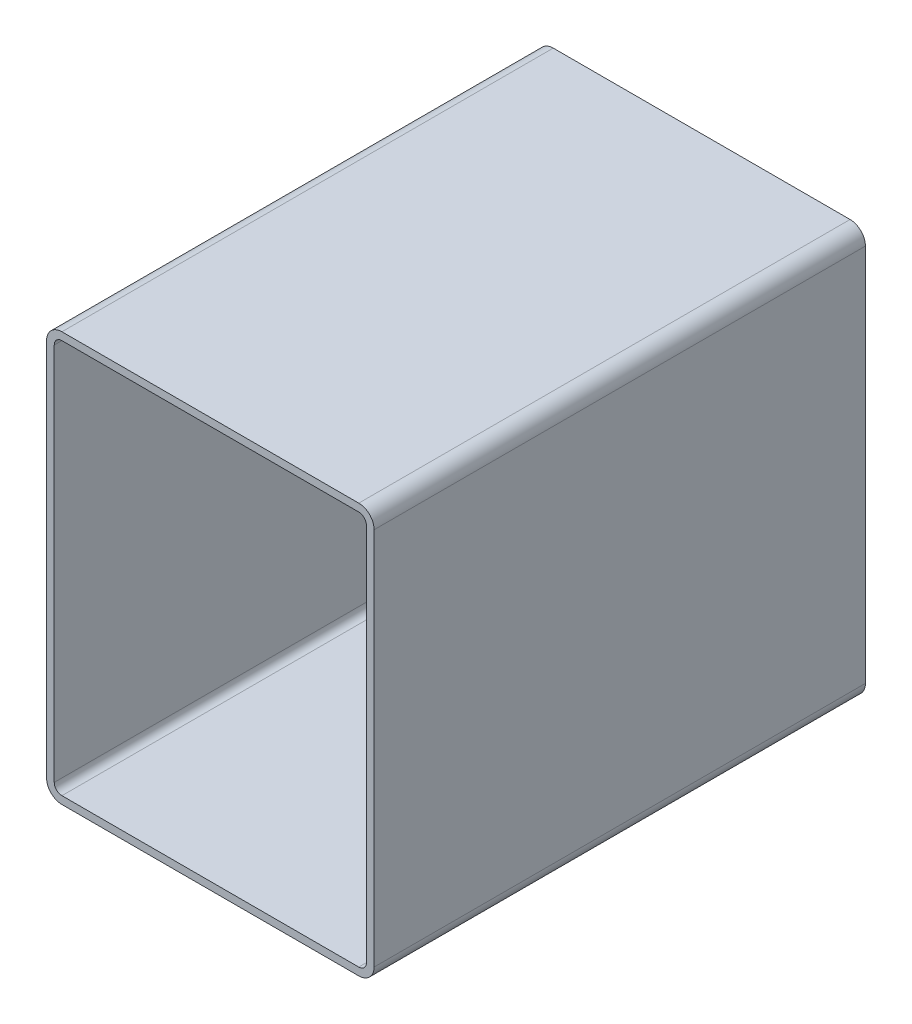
ISO-10303-21;
HEADER;
FILE_DESCRIPTION(('STEP AP214'),'2;1');
FILE_NAME('part.step','',(''),(''),'','','');
FILE_SCHEMA(('AUTOMOTIVE_DESIGN { 1 0 10303 214 1 1 1 1 }'));
ENDSEC;
DATA;
#1=APPLICATION_CONTEXT('core data for automotive mechanical design processes');
#2=APPLICATION_PROTOCOL_DEFINITION('international standard','automotive_design',2000,#1);
#3=PRODUCT_CONTEXT('',#1,'mechanical');
#4=PRODUCT('Part','Part','',(#3));
#5=PRODUCT_RELATED_PRODUCT_CATEGORY('part','',(#4));
#6=PRODUCT_DEFINITION_FORMATION('','',#4);
#7=PRODUCT_DEFINITION_CONTEXT('part definition',#1,'design');
#8=PRODUCT_DEFINITION('design','',#6,#7);
#9=PRODUCT_DEFINITION_SHAPE('','',#8);
#10=(LENGTH_UNIT() NAMED_UNIT(*) SI_UNIT(.MILLI.,.METRE.));
#11=(NAMED_UNIT(*) PLANE_ANGLE_UNIT() SI_UNIT($,.RADIAN.));
#12=(NAMED_UNIT(*) SI_UNIT($,.STERADIAN.) SOLID_ANGLE_UNIT());
#13=UNCERTAINTY_MEASURE_WITH_UNIT(LENGTH_MEASURE(1.E-05),#10,'distance_accuracy_value','');
#14=(GEOMETRIC_REPRESENTATION_CONTEXT(3) GLOBAL_UNCERTAINTY_ASSIGNED_CONTEXT((#13)) GLOBAL_UNIT_ASSIGNED_CONTEXT((#10,
#11,#12)) REPRESENTATION_CONTEXT('',''));
#15=CARTESIAN_POINT('',(0.,0.,0.));
#16=DIRECTION('',(0.,0.,1.));
#17=DIRECTION('',(1.,0.,0.));
#18=AXIS2_PLACEMENT_3D('',#15,#16,#17);
#19=CARTESIAN_POINT('',(10.9159404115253,246.395313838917,304.8));
#20=DIRECTION('',(0.,0.,1.));
#21=DIRECTION('',(1.,0.,0.));
#22=AXIS2_PLACEMENT_3D('',#19,#20,#21);
#23=PLANE('',#22);
#24=CARTESIAN_POINT('',(10.9159404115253,246.395313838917,304.8));
#25=DIRECTION('',(0.,0.,1.));
#26=DIRECTION('',(1.,0.,0.));
#27=AXIS2_PLACEMENT_3D('',#24,#25,#26);
#28=CIRCLE('',#27,9.52500000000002);
#29=CARTESIAN_POINT('',(10.9159404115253,255.920313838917,304.8));
#30=VERTEX_POINT('',#29);
#31=CARTESIAN_POINT('',(1.3909404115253,246.395313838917,304.8));
#32=VERTEX_POINT('',#31);
#33=EDGE_CURVE('E211',#30,#32,#28,.T.);
#34=ORIENTED_EDGE('',*,*,#33,.T.);
#35=DIRECTION('',(0.,-1.,0.));
#36=VECTOR('',#35,1.);
#37=CARTESIAN_POINT('',(1.3909404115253,11.4453138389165,304.8));
#38=LINE('',#37,#36);
#39=CARTESIAN_POINT('',(1.3909404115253,11.4453138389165,304.8));
#40=VERTEX_POINT('',#39);
#41=EDGE_CURVE('E214',#32,#40,#38,.T.);
#42=ORIENTED_EDGE('',*,*,#41,.T.);
#43=CARTESIAN_POINT('',(10.9159404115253,11.4453138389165,304.8));
#44=DIRECTION('',(0.,0.,1.));
#45=DIRECTION('',(1.,0.,0.));
#46=AXIS2_PLACEMENT_3D('',#43,#44,#45);
#47=CIRCLE('',#46,9.525);
#48=CARTESIAN_POINT('',(10.9159404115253,1.92031383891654,304.8));
#49=VERTEX_POINT('',#48);
#50=EDGE_CURVE('E217',#40,#49,#47,.T.);
#51=ORIENTED_EDGE('',*,*,#50,.T.);
#52=DIRECTION('',(1.,0.,0.));
#53=VECTOR('',#52,1.);
#54=CARTESIAN_POINT('',(195.065940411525,1.92031383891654,304.8));
#55=LINE('',#54,#53);
#56=CARTESIAN_POINT('',(195.065940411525,1.92031383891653,304.8));
#57=VERTEX_POINT('',#56);
#58=EDGE_CURVE('E219',#49,#57,#55,.T.);
#59=ORIENTED_EDGE('',*,*,#58,.T.);
#60=CARTESIAN_POINT('',(195.065940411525,11.4453138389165,304.8));
#61=DIRECTION('',(0.,0.,1.));
#62=DIRECTION('',(1.,0.,0.));
#63=AXIS2_PLACEMENT_3D('',#60,#61,#62);
#64=CIRCLE('',#63,9.525);
#65=CARTESIAN_POINT('',(204.590940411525,11.4453138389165,304.8));
#66=VERTEX_POINT('',#65);
#67=EDGE_CURVE('E221',#57,#66,#64,.T.);
#68=ORIENTED_EDGE('',*,*,#67,.T.);
#69=DIRECTION('',(0.,1.,0.));
#70=VECTOR('',#69,1.);
#71=CARTESIAN_POINT('',(204.590940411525,246.395313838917,304.8));
#72=LINE('',#71,#70);
#73=CARTESIAN_POINT('',(204.590940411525,246.395313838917,304.8));
#74=VERTEX_POINT('',#73);
#75=EDGE_CURVE('E223',#66,#74,#72,.T.);
#76=ORIENTED_EDGE('',*,*,#75,.T.);
#77=CARTESIAN_POINT('',(195.065940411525,246.395313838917,304.8));
#78=DIRECTION('',(0.,0.,1.));
#79=DIRECTION('',(1.,0.,0.));
#80=AXIS2_PLACEMENT_3D('',#77,#78,#79);
#81=CIRCLE('',#80,9.52500000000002);
#82=CARTESIAN_POINT('',(195.065940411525,255.920313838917,304.8));
#83=VERTEX_POINT('',#82);
#84=EDGE_CURVE('E225',#74,#83,#81,.T.);
#85=ORIENTED_EDGE('',*,*,#84,.T.);
#86=DIRECTION('',(-1.,0.,0.));
#87=VECTOR('',#86,1.);
#88=CARTESIAN_POINT('',(10.9159404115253,255.920313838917,304.8));
#89=LINE('',#88,#87);
#90=EDGE_CURVE('E227',#83,#30,#89,.T.);
#91=ORIENTED_EDGE('',*,*,#90,.T.);
#92=EDGE_LOOP('',(#34,#42,#51,#59,#68,#76,#85,#91));
#93=FACE_BOUND('',#92,.T.);
#94=DIRECTION('',(0.,-1.,0.));
#95=VECTOR('',#94,1.);
#96=CARTESIAN_POINT('',(6.1534404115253,11.4453138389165,304.8));
#97=LINE('',#96,#95);
#98=CARTESIAN_POINT('',(6.1534404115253,246.395313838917,304.8));
#99=VERTEX_POINT('',#98);
#100=CARTESIAN_POINT('',(6.1534404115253,11.4453138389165,304.8));
#101=VERTEX_POINT('',#100);
#102=EDGE_CURVE('E154',#99,#101,#97,.T.);
#103=ORIENTED_EDGE('',*,*,#102,.F.);
#104=CARTESIAN_POINT('',(10.9159404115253,246.395313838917,304.8));
#105=DIRECTION('',(0.,0.,1.));
#106=DIRECTION('',(1.,0.,0.));
#107=AXIS2_PLACEMENT_3D('',#104,#105,#106);
#108=CIRCLE('',#107,4.76250000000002);
#109=CARTESIAN_POINT('',(10.9159404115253,251.157813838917,304.8));
#110=VERTEX_POINT('',#109);
#111=EDGE_CURVE('E146',#110,#99,#108,.T.);
#112=ORIENTED_EDGE('',*,*,#111,.F.);
#113=DIRECTION('',(-1.,0.,0.));
#114=VECTOR('',#113,1.);
#115=CARTESIAN_POINT('',(10.9159404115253,251.157813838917,304.8));
#116=LINE('',#115,#114);
#117=CARTESIAN_POINT('',(195.065940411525,251.157813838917,304.8));
#118=VERTEX_POINT('',#117);
#119=EDGE_CURVE('E179',#118,#110,#116,.T.);
#120=ORIENTED_EDGE('',*,*,#119,.F.);
#121=CARTESIAN_POINT('',(195.065940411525,246.395313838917,304.8));
#122=DIRECTION('',(0.,0.,1.));
#123=DIRECTION('',(1.,0.,0.));
#124=AXIS2_PLACEMENT_3D('',#121,#122,#123);
#125=CIRCLE('',#124,4.76250000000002);
#126=CARTESIAN_POINT('',(199.828440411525,246.395313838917,304.8));
#127=VERTEX_POINT('',#126);
#128=EDGE_CURVE('E177',#127,#118,#125,.T.);
#129=ORIENTED_EDGE('',*,*,#128,.F.);
#130=DIRECTION('',(0.,1.,0.));
#131=VECTOR('',#130,1.);
#132=CARTESIAN_POINT('',(199.828440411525,246.395313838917,304.8));
#133=LINE('',#132,#131);
#134=CARTESIAN_POINT('',(199.828440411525,11.4453138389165,304.8));
#135=VERTEX_POINT('',#134);
#136=EDGE_CURVE('E175',#135,#127,#133,.T.);
#137=ORIENTED_EDGE('',*,*,#136,.F.);
#138=CARTESIAN_POINT('',(195.065940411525,11.4453138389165,304.8));
#139=DIRECTION('',(0.,0.,1.));
#140=DIRECTION('',(1.,0.,0.));
#141=AXIS2_PLACEMENT_3D('',#138,#139,#140);
#142=CIRCLE('',#141,4.7625);
#143=CARTESIAN_POINT('',(195.065940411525,6.68281383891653,304.8));
#144=VERTEX_POINT('',#143);
#145=EDGE_CURVE('E173',#144,#135,#142,.T.);
#146=ORIENTED_EDGE('',*,*,#145,.F.);
#147=DIRECTION('',(1.,0.,0.));
#148=VECTOR('',#147,1.);
#149=CARTESIAN_POINT('',(195.065940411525,6.68281383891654,304.8));
#150=LINE('',#149,#148);
#151=CARTESIAN_POINT('',(10.9159404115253,6.68281383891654,304.8));
#152=VERTEX_POINT('',#151);
#153=EDGE_CURVE('E169',#152,#144,#150,.T.);
#154=ORIENTED_EDGE('',*,*,#153,.F.);
#155=CARTESIAN_POINT('',(10.9159404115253,11.4453138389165,304.8));
#156=DIRECTION('',(0.,0.,1.));
#157=DIRECTION('',(1.,0.,0.));
#158=AXIS2_PLACEMENT_3D('',#155,#156,#157);
#159=CIRCLE('',#158,4.7625);
#160=EDGE_CURVE('E167',#101,#152,#159,.T.);
#161=ORIENTED_EDGE('',*,*,#160,.F.);
#162=EDGE_LOOP('',(#103,#112,#120,#129,#137,#146,#154,#161));
#163=FACE_BOUND('',#162,.T.);
#164=ADVANCED_FACE('F33',(#93,#163),#23,.T.);
#165=CARTESIAN_POINT('',(10.9159404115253,246.395313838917,0.));
#166=DIRECTION('',(0.,0.,1.));
#167=DIRECTION('',(1.,0.,0.));
#168=AXIS2_PLACEMENT_3D('',#165,#166,#167);
#169=PLANE('',#168);
#170=CARTESIAN_POINT('',(10.9159404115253,246.395313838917,0.));
#171=DIRECTION('',(0.,0.,1.));
#172=DIRECTION('',(1.,0.,0.));
#173=AXIS2_PLACEMENT_3D('',#170,#171,#172);
#174=CIRCLE('',#173,9.52500000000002);
#175=CARTESIAN_POINT('',(10.9159404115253,255.920313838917,0.));
#176=VERTEX_POINT('',#175);
#177=CARTESIAN_POINT('',(1.3909404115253,246.395313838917,0.));
#178=VERTEX_POINT('',#177);
#179=EDGE_CURVE('E162',#176,#178,#174,.T.);
#180=ORIENTED_EDGE('',*,*,#179,.F.);
#181=DIRECTION('',(-1.,0.,0.));
#182=VECTOR('',#181,1.);
#183=CARTESIAN_POINT('',(10.9159404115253,255.920313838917,0.));
#184=LINE('',#183,#182);
#185=CARTESIAN_POINT('',(195.065940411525,255.920313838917,0.));
#186=VERTEX_POINT('',#185);
#187=EDGE_CURVE('E215',#186,#176,#184,.T.);
#188=ORIENTED_EDGE('',*,*,#187,.F.);
#189=CARTESIAN_POINT('',(195.065940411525,246.395313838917,0.));
#190=DIRECTION('',(0.,0.,1.));
#191=DIRECTION('',(1.,0.,0.));
#192=AXIS2_PLACEMENT_3D('',#189,#190,#191);
#193=CIRCLE('',#192,9.52500000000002);
#194=CARTESIAN_POINT('',(204.590940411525,246.395313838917,0.));
#195=VERTEX_POINT('',#194);
#196=EDGE_CURVE('E242',#195,#186,#193,.T.);
#197=ORIENTED_EDGE('',*,*,#196,.F.);
#198=DIRECTION('',(0.,1.,0.));
#199=VECTOR('',#198,1.);
#200=CARTESIAN_POINT('',(204.590940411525,246.395313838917,0.));
#201=LINE('',#200,#199);
#202=CARTESIAN_POINT('',(204.590940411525,11.4453138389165,0.));
#203=VERTEX_POINT('',#202);
#204=EDGE_CURVE('E240',#203,#195,#201,.T.);
#205=ORIENTED_EDGE('',*,*,#204,.F.);
#206=CARTESIAN_POINT('',(195.065940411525,11.4453138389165,0.));
#207=DIRECTION('',(0.,0.,1.));
#208=DIRECTION('',(1.,0.,0.));
#209=AXIS2_PLACEMENT_3D('',#206,#207,#208);
#210=CIRCLE('',#209,9.525);
#211=CARTESIAN_POINT('',(195.065940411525,1.92031383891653,0.));
#212=VERTEX_POINT('',#211);
#213=EDGE_CURVE('E238',#212,#203,#210,.T.);
#214=ORIENTED_EDGE('',*,*,#213,.F.);
#215=DIRECTION('',(1.,0.,0.));
#216=VECTOR('',#215,1.);
#217=CARTESIAN_POINT('',(195.065940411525,1.92031383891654,0.));
#218=LINE('',#217,#216);
#219=CARTESIAN_POINT('',(10.9159404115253,1.92031383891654,0.));
#220=VERTEX_POINT('',#219);
#221=EDGE_CURVE('E236',#220,#212,#218,.T.);
#222=ORIENTED_EDGE('',*,*,#221,.F.);
#223=CARTESIAN_POINT('',(10.9159404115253,11.4453138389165,0.));
#224=DIRECTION('',(0.,0.,1.));
#225=DIRECTION('',(1.,0.,0.));
#226=AXIS2_PLACEMENT_3D('',#223,#224,#225);
#227=CIRCLE('',#226,9.525);
#228=CARTESIAN_POINT('',(1.3909404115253,11.4453138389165,0.));
#229=VERTEX_POINT('',#228);
#230=EDGE_CURVE('E234',#229,#220,#227,.T.);
#231=ORIENTED_EDGE('',*,*,#230,.F.);
#232=DIRECTION('',(0.,-1.,0.));
#233=VECTOR('',#232,1.);
#234=CARTESIAN_POINT('',(1.3909404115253,11.4453138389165,0.));
#235=LINE('',#234,#233);
#236=EDGE_CURVE('E232',#178,#229,#235,.T.);
#237=ORIENTED_EDGE('',*,*,#236,.F.);
#238=EDGE_LOOP('',(#180,#188,#197,#205,#214,#222,#231,#237));
#239=FACE_BOUND('',#238,.T.);
#240=CARTESIAN_POINT('',(10.9159404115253,246.395313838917,0.));
#241=DIRECTION('',(0.,0.,1.));
#242=DIRECTION('',(1.,0.,0.));
#243=AXIS2_PLACEMENT_3D('',#240,#241,#242);
#244=CIRCLE('',#243,4.76250000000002);
#245=CARTESIAN_POINT('',(10.9159404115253,251.157813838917,0.));
#246=VERTEX_POINT('',#245);
#247=CARTESIAN_POINT('',(6.1534404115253,246.395313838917,0.));
#248=VERTEX_POINT('',#247);
#249=EDGE_CURVE('E56',#246,#248,#244,.T.);
#250=ORIENTED_EDGE('',*,*,#249,.T.);
#251=DIRECTION('',(0.,-1.,0.));
#252=VECTOR('',#251,1.);
#253=CARTESIAN_POINT('',(6.1534404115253,11.4453138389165,0.));
#254=LINE('',#253,#252);
#255=CARTESIAN_POINT('',(6.1534404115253,11.4453138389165,0.));
#256=VERTEX_POINT('',#255);
#257=EDGE_CURVE('E161',#248,#256,#254,.T.);
#258=ORIENTED_EDGE('',*,*,#257,.T.);
#259=CARTESIAN_POINT('',(10.9159404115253,11.4453138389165,0.));
#260=DIRECTION('',(0.,0.,1.));
#261=DIRECTION('',(1.,0.,0.));
#262=AXIS2_PLACEMENT_3D('',#259,#260,#261);
#263=CIRCLE('',#262,4.7625);
#264=CARTESIAN_POINT('',(10.9159404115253,6.68281383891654,0.));
#265=VERTEX_POINT('',#264);
#266=EDGE_CURVE('E183',#256,#265,#263,.T.);
#267=ORIENTED_EDGE('',*,*,#266,.T.);
#268=DIRECTION('',(1.,0.,0.));
#269=VECTOR('',#268,1.);
#270=CARTESIAN_POINT('',(195.065940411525,6.68281383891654,0.));
#271=LINE('',#270,#269);
#272=CARTESIAN_POINT('',(195.065940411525,6.68281383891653,0.));
#273=VERTEX_POINT('',#272);
#274=EDGE_CURVE('E186',#265,#273,#271,.T.);
#275=ORIENTED_EDGE('',*,*,#274,.T.);
#276=CARTESIAN_POINT('',(195.065940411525,11.4453138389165,0.));
#277=DIRECTION('',(0.,0.,1.));
#278=DIRECTION('',(1.,0.,0.));
#279=AXIS2_PLACEMENT_3D('',#276,#277,#278);
#280=CIRCLE('',#279,4.7625);
#281=CARTESIAN_POINT('',(199.828440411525,11.4453138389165,0.));
#282=VERTEX_POINT('',#281);
#283=EDGE_CURVE('E189',#273,#282,#280,.T.);
#284=ORIENTED_EDGE('',*,*,#283,.T.);
#285=DIRECTION('',(0.,1.,0.));
#286=VECTOR('',#285,1.);
#287=CARTESIAN_POINT('',(199.828440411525,246.395313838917,0.));
#288=LINE('',#287,#286);
#289=CARTESIAN_POINT('',(199.828440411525,246.395313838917,0.));
#290=VERTEX_POINT('',#289);
#291=EDGE_CURVE('E192',#282,#290,#288,.T.);
#292=ORIENTED_EDGE('',*,*,#291,.T.);
#293=CARTESIAN_POINT('',(195.065940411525,246.395313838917,0.));
#294=DIRECTION('',(0.,0.,1.));
#295=DIRECTION('',(1.,0.,0.));
#296=AXIS2_PLACEMENT_3D('',#293,#294,#295);
#297=CIRCLE('',#296,4.76250000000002);
#298=CARTESIAN_POINT('',(195.065940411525,251.157813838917,0.));
#299=VERTEX_POINT('',#298);
#300=EDGE_CURVE('E195',#290,#299,#297,.T.);
#301=ORIENTED_EDGE('',*,*,#300,.T.);
#302=DIRECTION('',(-1.,0.,0.));
#303=VECTOR('',#302,1.);
#304=CARTESIAN_POINT('',(10.9159404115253,251.157813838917,0.));
#305=LINE('',#304,#303);
#306=EDGE_CURVE('E155',#299,#246,#305,.T.);
#307=ORIENTED_EDGE('',*,*,#306,.T.);
#308=EDGE_LOOP('',(#250,#258,#267,#275,#284,#292,#301,#307));
#309=FACE_BOUND('',#308,.T.);
#310=ADVANCED_FACE('F272',(#239,#309),#169,.F.);
#311=CARTESIAN_POINT('',(10.9159404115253,246.395313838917,304.8));
#312=DIRECTION('',(0.,0.,-1.));
#313=DIRECTION('',(-1.,0.,0.));
#314=AXIS2_PLACEMENT_3D('',#311,#312,#313);
#315=CYLINDRICAL_SURFACE('',#314,9.52500000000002);
#316=ORIENTED_EDGE('',*,*,#179,.T.);
#317=DIRECTION('',(0.,0.,-1.));
#318=VECTOR('',#317,1.);
#319=CARTESIAN_POINT('',(1.3909404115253,246.395313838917,304.8));
#320=LINE('',#319,#318);
#321=EDGE_CURVE('E11',#32,#178,#320,.T.);
#322=ORIENTED_EDGE('',*,*,#321,.F.);
#323=ORIENTED_EDGE('',*,*,#33,.F.);
#324=DIRECTION('',(0.,0.,-1.));
#325=VECTOR('',#324,1.);
#326=CARTESIAN_POINT('',(10.9159404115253,255.920313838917,304.8));
#327=LINE('',#326,#325);
#328=EDGE_CURVE('E229',#30,#176,#327,.T.);
#329=ORIENTED_EDGE('',*,*,#328,.T.);
#330=EDGE_LOOP('',(#316,#322,#323,#329));
#331=FACE_BOUND('',#330,.T.);
#332=ADVANCED_FACE('F35',(#331),#315,.T.);
#333=CARTESIAN_POINT('',(1.3909404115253,11.4453138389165,304.8));
#334=DIRECTION('',(1.,0.,0.));
#335=DIRECTION('',(0.,0.,-1.));
#336=AXIS2_PLACEMENT_3D('',#333,#334,#335);
#337=PLANE('',#336);
#338=ORIENTED_EDGE('',*,*,#236,.T.);
#339=DIRECTION('',(0.,0.,-1.));
#340=VECTOR('',#339,1.);
#341=CARTESIAN_POINT('',(1.3909404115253,11.4453138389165,304.8));
#342=LINE('',#341,#340);
#343=EDGE_CURVE('E41',#40,#229,#342,.T.);
#344=ORIENTED_EDGE('',*,*,#343,.F.);
#345=ORIENTED_EDGE('',*,*,#41,.F.);
#346=ORIENTED_EDGE('',*,*,#321,.T.);
#347=EDGE_LOOP('',(#338,#344,#345,#346));
#348=FACE_BOUND('',#347,.T.);
#349=ADVANCED_FACE('F289',(#348),#337,.F.);
#350=CARTESIAN_POINT('',(10.9159404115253,11.4453138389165,304.8));
#351=DIRECTION('',(0.,0.,-1.));
#352=DIRECTION('',(-1.,0.,0.));
#353=AXIS2_PLACEMENT_3D('',#350,#351,#352);
#354=CYLINDRICAL_SURFACE('',#353,9.525);
#355=ORIENTED_EDGE('',*,*,#230,.T.);
#356=DIRECTION('',(0.,0.,-1.));
#357=VECTOR('',#356,1.);
#358=CARTESIAN_POINT('',(10.9159404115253,1.92031383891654,304.8));
#359=LINE('',#358,#357);
#360=EDGE_CURVE('E259',#49,#220,#359,.T.);
#361=ORIENTED_EDGE('',*,*,#360,.F.);
#362=ORIENTED_EDGE('',*,*,#50,.F.);
#363=ORIENTED_EDGE('',*,*,#343,.T.);
#364=EDGE_LOOP('',(#355,#361,#362,#363));
#365=FACE_BOUND('',#364,.T.);
#366=ADVANCED_FACE('F266',(#365),#354,.T.);
#367=CARTESIAN_POINT('',(195.065940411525,1.92031383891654,304.8));
#368=DIRECTION('',(0.,1.,0.));
#369=DIRECTION('',(0.,0.,1.));
#370=AXIS2_PLACEMENT_3D('',#367,#368,#369);
#371=PLANE('',#370);
#372=ORIENTED_EDGE('',*,*,#221,.T.);
#373=DIRECTION('',(0.,0.,-1.));
#374=VECTOR('',#373,1.);
#375=CARTESIAN_POINT('',(195.065940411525,1.92031383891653,304.8));
#376=LINE('',#375,#374);
#377=EDGE_CURVE('E256',#57,#212,#376,.T.);
#378=ORIENTED_EDGE('',*,*,#377,.F.);
#379=ORIENTED_EDGE('',*,*,#58,.F.);
#380=ORIENTED_EDGE('',*,*,#360,.T.);
#381=EDGE_LOOP('',(#372,#378,#379,#380));
#382=FACE_BOUND('',#381,.T.);
#383=ADVANCED_FACE('F278',(#382),#371,.F.);
#384=CARTESIAN_POINT('',(195.065940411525,11.4453138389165,304.8));
#385=DIRECTION('',(0.,0.,-1.));
#386=DIRECTION('',(-1.,0.,0.));
#387=AXIS2_PLACEMENT_3D('',#384,#385,#386);
#388=CYLINDRICAL_SURFACE('',#387,9.525);
#389=ORIENTED_EDGE('',*,*,#213,.T.);
#390=DIRECTION('',(0.,0.,-1.));
#391=VECTOR('',#390,1.);
#392=CARTESIAN_POINT('',(204.590940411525,11.4453138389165,304.8));
#393=LINE('',#392,#391);
#394=EDGE_CURVE('E253',#66,#203,#393,.T.);
#395=ORIENTED_EDGE('',*,*,#394,.F.);
#396=ORIENTED_EDGE('',*,*,#67,.F.);
#397=ORIENTED_EDGE('',*,*,#377,.T.);
#398=EDGE_LOOP('',(#389,#395,#396,#397));
#399=FACE_BOUND('',#398,.T.);
#400=ADVANCED_FACE('F282',(#399),#388,.T.);
#401=CARTESIAN_POINT('',(204.590940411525,246.395313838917,304.8));
#402=DIRECTION('',(-1.,0.,0.));
#403=DIRECTION('',(0.,0.,1.));
#404=AXIS2_PLACEMENT_3D('',#401,#402,#403);
#405=PLANE('',#404);
#406=ORIENTED_EDGE('',*,*,#204,.T.);
#407=DIRECTION('',(0.,0.,-1.));
#408=VECTOR('',#407,1.);
#409=CARTESIAN_POINT('',(204.590940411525,246.395313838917,304.8));
#410=LINE('',#409,#408);
#411=EDGE_CURVE('E250',#74,#195,#410,.T.);
#412=ORIENTED_EDGE('',*,*,#411,.F.);
#413=ORIENTED_EDGE('',*,*,#75,.F.);
#414=ORIENTED_EDGE('',*,*,#394,.T.);
#415=EDGE_LOOP('',(#406,#412,#413,#414));
#416=FACE_BOUND('',#415,.T.);
#417=ADVANCED_FACE('F302',(#416),#405,.F.);
#418=CARTESIAN_POINT('',(195.065940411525,246.395313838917,304.8));
#419=DIRECTION('',(0.,0.,-1.));
#420=DIRECTION('',(-1.,0.,0.));
#421=AXIS2_PLACEMENT_3D('',#418,#419,#420);
#422=CYLINDRICAL_SURFACE('',#421,9.52500000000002);
#423=ORIENTED_EDGE('',*,*,#196,.T.);
#424=DIRECTION('',(0.,0.,-1.));
#425=VECTOR('',#424,1.);
#426=CARTESIAN_POINT('',(195.065940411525,255.920313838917,304.8));
#427=LINE('',#426,#425);
#428=EDGE_CURVE('E247',#83,#186,#427,.T.);
#429=ORIENTED_EDGE('',*,*,#428,.F.);
#430=ORIENTED_EDGE('',*,*,#84,.F.);
#431=ORIENTED_EDGE('',*,*,#411,.T.);
#432=EDGE_LOOP('',(#423,#429,#430,#431));
#433=FACE_BOUND('',#432,.T.);
#434=ADVANCED_FACE('F300',(#433),#422,.T.);
#435=CARTESIAN_POINT('',(10.9159404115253,255.920313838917,304.8));
#436=DIRECTION('',(0.,-1.,0.));
#437=DIRECTION('',(0.,0.,-1.));
#438=AXIS2_PLACEMENT_3D('',#435,#436,#437);
#439=PLANE('',#438);
#440=ORIENTED_EDGE('',*,*,#187,.T.);
#441=ORIENTED_EDGE('',*,*,#328,.F.);
#442=ORIENTED_EDGE('',*,*,#90,.F.);
#443=ORIENTED_EDGE('',*,*,#428,.T.);
#444=EDGE_LOOP('',(#440,#441,#442,#443));
#445=FACE_BOUND('',#444,.T.);
#446=ADVANCED_FACE('F295',(#445),#439,.F.);
#447=CARTESIAN_POINT('',(10.9159404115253,246.395313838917,304.8));
#448=DIRECTION('',(0.,0.,-1.));
#449=DIRECTION('',(-1.,0.,0.));
#450=AXIS2_PLACEMENT_3D('',#447,#448,#449);
#451=CYLINDRICAL_SURFACE('',#450,4.76250000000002);
#452=ORIENTED_EDGE('',*,*,#249,.F.);
#453=DIRECTION('',(0.,0.,-1.));
#454=VECTOR('',#453,1.);
#455=CARTESIAN_POINT('',(10.9159404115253,251.157813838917,304.8));
#456=LINE('',#455,#454);
#457=EDGE_CURVE('E150',#110,#246,#456,.T.);
#458=ORIENTED_EDGE('',*,*,#457,.F.);
#459=ORIENTED_EDGE('',*,*,#111,.T.);
#460=DIRECTION('',(0.,0.,-1.));
#461=VECTOR('',#460,1.);
#462=CARTESIAN_POINT('',(6.1534404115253,246.395313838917,304.8));
#463=LINE('',#462,#461);
#464=EDGE_CURVE('E149',#99,#248,#463,.T.);
#465=ORIENTED_EDGE('',*,*,#464,.T.);
#466=EDGE_LOOP('',(#452,#458,#459,#465));
#467=FACE_BOUND('',#466,.T.);
#468=ADVANCED_FACE('F148',(#467),#451,.F.);
#469=CARTESIAN_POINT('',(6.1534404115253,11.4453138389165,304.8));
#470=DIRECTION('',(1.,0.,0.));
#471=DIRECTION('',(0.,0.,-1.));
#472=AXIS2_PLACEMENT_3D('',#469,#470,#471);
#473=PLANE('',#472);
#474=ORIENTED_EDGE('',*,*,#257,.F.);
#475=ORIENTED_EDGE('',*,*,#464,.F.);
#476=ORIENTED_EDGE('',*,*,#102,.T.);
#477=DIRECTION('',(0.,0.,-1.));
#478=VECTOR('',#477,1.);
#479=CARTESIAN_POINT('',(6.1534404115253,11.4453138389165,304.8));
#480=LINE('',#479,#478);
#481=EDGE_CURVE('E163',#101,#256,#480,.T.);
#482=ORIENTED_EDGE('',*,*,#481,.T.);
#483=EDGE_LOOP('',(#474,#475,#476,#482));
#484=FACE_BOUND('',#483,.T.);
#485=ADVANCED_FACE('F158',(#484),#473,.T.);
#486=CARTESIAN_POINT('',(10.9159404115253,11.4453138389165,304.8));
#487=DIRECTION('',(0.,0.,-1.));
#488=DIRECTION('',(-1.,0.,0.));
#489=AXIS2_PLACEMENT_3D('',#486,#487,#488);
#490=CYLINDRICAL_SURFACE('',#489,4.7625);
#491=ORIENTED_EDGE('',*,*,#266,.F.);
#492=ORIENTED_EDGE('',*,*,#481,.F.);
#493=ORIENTED_EDGE('',*,*,#160,.T.);
#494=DIRECTION('',(0.,0.,-1.));
#495=VECTOR('',#494,1.);
#496=CARTESIAN_POINT('',(10.9159404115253,6.68281383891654,304.8));
#497=LINE('',#496,#495);
#498=EDGE_CURVE('E208',#152,#265,#497,.T.);
#499=ORIENTED_EDGE('',*,*,#498,.T.);
#500=EDGE_LOOP('',(#491,#492,#493,#499));
#501=FACE_BOUND('',#500,.T.);
#502=ADVANCED_FACE('F327',(#501),#490,.F.);
#503=CARTESIAN_POINT('',(195.065940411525,6.68281383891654,304.8));
#504=DIRECTION('',(0.,1.,0.));
#505=DIRECTION('',(0.,0.,1.));
#506=AXIS2_PLACEMENT_3D('',#503,#504,#505);
#507=PLANE('',#506);
#508=ORIENTED_EDGE('',*,*,#274,.F.);
#509=ORIENTED_EDGE('',*,*,#498,.F.);
#510=ORIENTED_EDGE('',*,*,#153,.T.);
#511=DIRECTION('',(0.,0.,-1.));
#512=VECTOR('',#511,1.);
#513=CARTESIAN_POINT('',(195.065940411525,6.68281383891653,304.8));
#514=LINE('',#513,#512);
#515=EDGE_CURVE('E206',#144,#273,#514,.T.);
#516=ORIENTED_EDGE('',*,*,#515,.T.);
#517=EDGE_LOOP('',(#508,#509,#510,#516));
#518=FACE_BOUND('',#517,.T.);
#519=ADVANCED_FACE('F331',(#518),#507,.T.);
#520=CARTESIAN_POINT('',(195.065940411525,11.4453138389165,304.8));
#521=DIRECTION('',(0.,0.,-1.));
#522=DIRECTION('',(-1.,0.,0.));
#523=AXIS2_PLACEMENT_3D('',#520,#521,#522);
#524=CYLINDRICAL_SURFACE('',#523,4.7625);
#525=ORIENTED_EDGE('',*,*,#283,.F.);
#526=ORIENTED_EDGE('',*,*,#515,.F.);
#527=ORIENTED_EDGE('',*,*,#145,.T.);
#528=DIRECTION('',(0.,0.,-1.));
#529=VECTOR('',#528,1.);
#530=CARTESIAN_POINT('',(199.828440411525,11.4453138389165,304.8));
#531=LINE('',#530,#529);
#532=EDGE_CURVE('E204',#135,#282,#531,.T.);
#533=ORIENTED_EDGE('',*,*,#532,.T.);
#534=EDGE_LOOP('',(#525,#526,#527,#533));
#535=FACE_BOUND('',#534,.T.);
#536=ADVANCED_FACE('F337',(#535),#524,.F.);
#537=CARTESIAN_POINT('',(199.828440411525,246.395313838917,304.8));
#538=DIRECTION('',(-1.,0.,0.));
#539=DIRECTION('',(0.,0.,1.));
#540=AXIS2_PLACEMENT_3D('',#537,#538,#539);
#541=PLANE('',#540);
#542=ORIENTED_EDGE('',*,*,#291,.F.);
#543=ORIENTED_EDGE('',*,*,#532,.F.);
#544=ORIENTED_EDGE('',*,*,#136,.T.);
#545=DIRECTION('',(0.,0.,-1.));
#546=VECTOR('',#545,1.);
#547=CARTESIAN_POINT('',(199.828440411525,246.395313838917,304.8));
#548=LINE('',#547,#546);
#549=EDGE_CURVE('E202',#127,#290,#548,.T.);
#550=ORIENTED_EDGE('',*,*,#549,.T.);
#551=EDGE_LOOP('',(#542,#543,#544,#550));
#552=FACE_BOUND('',#551,.T.);
#553=ADVANCED_FACE('F341',(#552),#541,.T.);
#554=CARTESIAN_POINT('',(195.065940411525,246.395313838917,304.8));
#555=DIRECTION('',(0.,0.,-1.));
#556=DIRECTION('',(-1.,0.,0.));
#557=AXIS2_PLACEMENT_3D('',#554,#555,#556);
#558=CYLINDRICAL_SURFACE('',#557,4.76250000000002);
#559=ORIENTED_EDGE('',*,*,#300,.F.);
#560=ORIENTED_EDGE('',*,*,#549,.F.);
#561=ORIENTED_EDGE('',*,*,#128,.T.);
#562=DIRECTION('',(0.,0.,-1.));
#563=VECTOR('',#562,1.);
#564=CARTESIAN_POINT('',(195.065940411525,251.157813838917,304.8));
#565=LINE('',#564,#563);
#566=EDGE_CURVE('E48',#118,#299,#565,.T.);
#567=ORIENTED_EDGE('',*,*,#566,.T.);
#568=EDGE_LOOP('',(#559,#560,#561,#567));
#569=FACE_BOUND('',#568,.T.);
#570=ADVANCED_FACE('F345',(#569),#558,.F.);
#571=CARTESIAN_POINT('',(10.9159404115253,251.157813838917,304.8));
#572=DIRECTION('',(0.,-1.,0.));
#573=DIRECTION('',(0.,0.,-1.));
#574=AXIS2_PLACEMENT_3D('',#571,#572,#573);
#575=PLANE('',#574);
#576=ORIENTED_EDGE('',*,*,#306,.F.);
#577=ORIENTED_EDGE('',*,*,#566,.F.);
#578=ORIENTED_EDGE('',*,*,#119,.T.);
#579=ORIENTED_EDGE('',*,*,#457,.T.);
#580=EDGE_LOOP('',(#576,#577,#578,#579));
#581=FACE_BOUND('',#580,.T.);
#582=ADVANCED_FACE('F349',(#581),#575,.T.);
#583=CLOSED_SHELL('',(#164,#310,#332,#349,#366,#383,#400,#417,#434,#446,#468,#485,#502,#519,
#536,#553,#570,#582));
#584=MANIFOLD_SOLID_BREP('B2',#583);
#585=ADVANCED_BREP_SHAPE_REPRESENTATION('',(#18,#584),#14);
#586=SHAPE_DEFINITION_REPRESENTATION(#9,#585);
ENDSEC;
END-ISO-10303-21;
